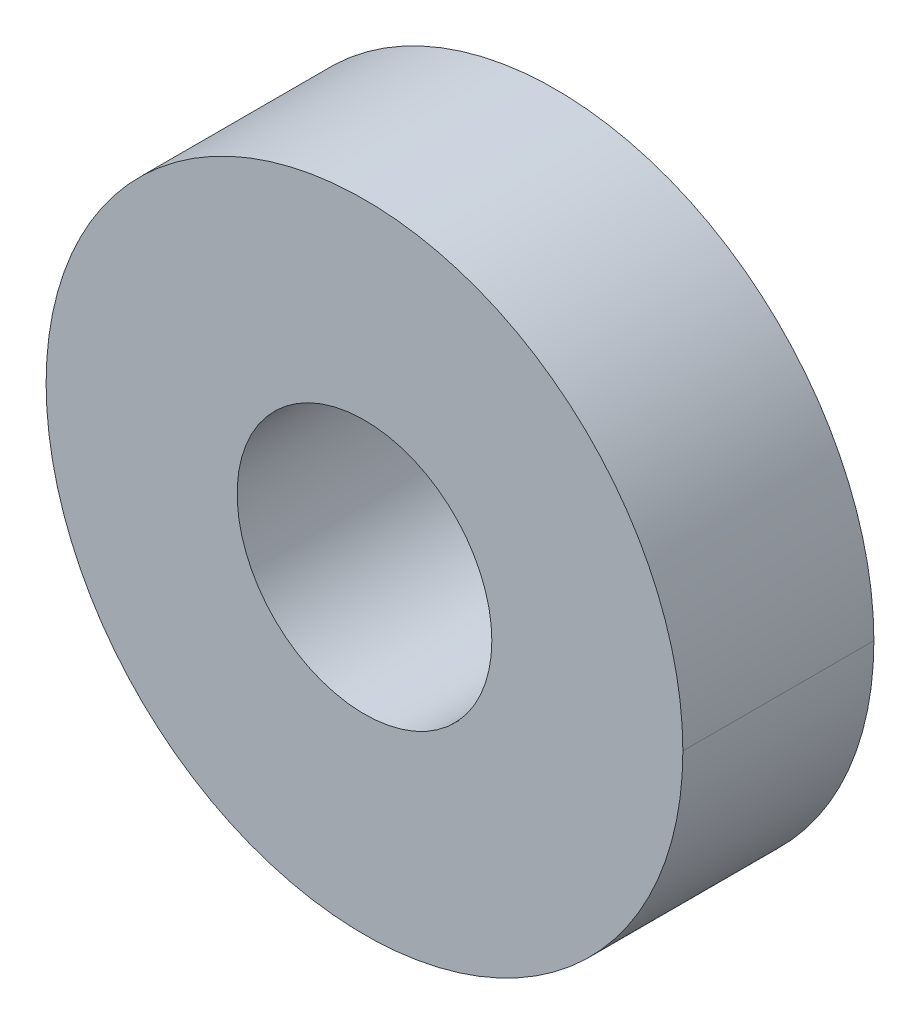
ISO-10303-21;
HEADER;
FILE_DESCRIPTION(('STEP AP214'),'2;1');
FILE_NAME('part.step','',(''),(''),'','','');
FILE_SCHEMA(('AUTOMOTIVE_DESIGN { 1 0 10303 214 1 1 1 1 }'));
ENDSEC;
DATA;
#1=APPLICATION_CONTEXT('core data for automotive mechanical design processes');
#2=APPLICATION_PROTOCOL_DEFINITION('international standard','automotive_design',2000,#1);
#3=PRODUCT_CONTEXT('',#1,'mechanical');
#4=PRODUCT('Part','Part','',(#3));
#5=PRODUCT_RELATED_PRODUCT_CATEGORY('part','',(#4));
#6=PRODUCT_DEFINITION_FORMATION('','',#4);
#7=PRODUCT_DEFINITION_CONTEXT('part definition',#1,'design');
#8=PRODUCT_DEFINITION('design','',#6,#7);
#9=PRODUCT_DEFINITION_SHAPE('','',#8);
#10=(LENGTH_UNIT() NAMED_UNIT(*) SI_UNIT(.MILLI.,.METRE.));
#11=(NAMED_UNIT(*) PLANE_ANGLE_UNIT() SI_UNIT($,.RADIAN.));
#12=(NAMED_UNIT(*) SI_UNIT($,.STERADIAN.) SOLID_ANGLE_UNIT());
#13=UNCERTAINTY_MEASURE_WITH_UNIT(LENGTH_MEASURE(1.E-05),#10,'distance_accuracy_value','');
#14=(GEOMETRIC_REPRESENTATION_CONTEXT(3) GLOBAL_UNCERTAINTY_ASSIGNED_CONTEXT((#13)) GLOBAL_UNIT_ASSIGNED_CONTEXT((#10,
#11,#12)) REPRESENTATION_CONTEXT('',''));
#15=CARTESIAN_POINT('',(0.,0.,0.));
#16=DIRECTION('',(0.,0.,1.));
#17=DIRECTION('',(1.,0.,0.));
#18=AXIS2_PLACEMENT_3D('',#15,#16,#17);
#19=CARTESIAN_POINT('',(8.93120842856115,26.4578481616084,0.));
#20=DIRECTION('',(0.,0.,1.));
#21=DIRECTION('',(1.,0.,0.));
#22=AXIS2_PLACEMENT_3D('',#19,#20,#21);
#23=PLANE('',#22);
#24=CARTESIAN_POINT('',(8.93120842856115,26.4578481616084,0.));
#25=DIRECTION('',(0.,0.,1.));
#26=DIRECTION('',(1.,0.,0.));
#27=AXIS2_PLACEMENT_3D('',#24,#25,#26);
#28=CIRCLE('',#27,2.);
#29=CARTESIAN_POINT('',(10.9312084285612,26.4578481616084,0.));
#30=VERTEX_POINT('',#29);
#31=EDGE_CURVE('E60',#30,#30,#28,.T.);
#32=ORIENTED_EDGE('',*,*,#31,.T.);
#33=EDGE_LOOP('',(#32));
#34=FACE_BOUND('',#33,.T.);
#35=CARTESIAN_POINT('',(8.93120842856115,26.4578481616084,0.));
#36=DIRECTION('',(0.,0.,-1.));
#37=DIRECTION('',(-1.,0.,0.));
#38=AXIS2_PLACEMENT_3D('',#35,#36,#37);
#39=CIRCLE('',#38,5.);
#40=CARTESIAN_POINT('',(13.9312084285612,26.4578481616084,0.));
#41=VERTEX_POINT('',#40);
#42=CARTESIAN_POINT('',(3.93120842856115,26.4578481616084,0.));
#43=VERTEX_POINT('',#42);
#44=EDGE_CURVE('E61',#41,#43,#39,.F.);
#45=ORIENTED_EDGE('',*,*,#44,.F.);
#46=CARTESIAN_POINT('',(8.93120842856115,26.4578481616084,0.));
#47=DIRECTION('',(0.,0.,-1.));
#48=DIRECTION('',(-1.,0.,0.));
#49=AXIS2_PLACEMENT_3D('',#46,#47,#48);
#50=CIRCLE('',#49,5.);
#51=EDGE_CURVE('E33',#43,#41,#50,.F.);
#52=ORIENTED_EDGE('',*,*,#51,.F.);
#53=EDGE_LOOP('',(#45,#52));
#54=FACE_BOUND('',#53,.T.);
#55=ADVANCED_FACE('F30',(#34,#54),#23,.F.);
#56=CARTESIAN_POINT('',(8.93120842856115,26.4578481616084,3.));
#57=DIRECTION('',(0.,0.,-1.));
#58=DIRECTION('',(-1.,0.,0.));
#59=AXIS2_PLACEMENT_3D('',#56,#57,#58);
#60=CYLINDRICAL_SURFACE('',#59,5.);
#61=DIRECTION('',(0.,0.,-1.));
#62=VECTOR('',#61,1.);
#63=CARTESIAN_POINT('',(3.93120842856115,26.4578481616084,3.));
#64=LINE('',#63,#62);
#65=CARTESIAN_POINT('',(3.93120842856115,26.4578481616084,3.));
#66=VERTEX_POINT('',#65);
#67=EDGE_CURVE('E58',#43,#66,#64,.F.);
#68=ORIENTED_EDGE('',*,*,#67,.F.);
#69=ORIENTED_EDGE('',*,*,#51,.T.);
#70=DIRECTION('',(0.,0.,-1.));
#71=VECTOR('',#70,1.);
#72=CARTESIAN_POINT('',(13.9312084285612,26.4578481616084,3.));
#73=LINE('',#72,#71);
#74=CARTESIAN_POINT('',(13.9312084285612,26.4578481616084,3.));
#75=VERTEX_POINT('',#74);
#76=EDGE_CURVE('E48',#75,#41,#73,.T.);
#77=ORIENTED_EDGE('',*,*,#76,.F.);
#78=CARTESIAN_POINT('',(8.93120842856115,26.4578481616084,3.));
#79=DIRECTION('',(0.,0.,-1.));
#80=DIRECTION('',(-1.,0.,0.));
#81=AXIS2_PLACEMENT_3D('',#78,#79,#80);
#82=CIRCLE('',#81,5.);
#83=EDGE_CURVE('E39',#66,#75,#82,.F.);
#84=ORIENTED_EDGE('',*,*,#83,.F.);
#85=EDGE_LOOP('',(#68,#69,#77,#84));
#86=FACE_BOUND('',#85,.T.);
#87=ADVANCED_FACE('F56',(#86),#60,.T.);
#88=CARTESIAN_POINT('',(8.93120842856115,26.4578481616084,3.));
#89=DIRECTION('',(0.,0.,-1.));
#90=DIRECTION('',(-1.,0.,0.));
#91=AXIS2_PLACEMENT_3D('',#88,#89,#90);
#92=CYLINDRICAL_SURFACE('',#91,5.);
#93=ORIENTED_EDGE('',*,*,#44,.T.);
#94=ORIENTED_EDGE('',*,*,#67,.T.);
#95=CARTESIAN_POINT('',(8.93120842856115,26.4578481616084,3.));
#96=DIRECTION('',(0.,0.,-1.));
#97=DIRECTION('',(-1.,0.,0.));
#98=AXIS2_PLACEMENT_3D('',#95,#96,#97);
#99=CIRCLE('',#98,5.);
#100=EDGE_CURVE('E11',#75,#66,#99,.F.);
#101=ORIENTED_EDGE('',*,*,#100,.F.);
#102=ORIENTED_EDGE('',*,*,#76,.T.);
#103=EDGE_LOOP('',(#93,#94,#101,#102));
#104=FACE_BOUND('',#103,.T.);
#105=ADVANCED_FACE('F63',(#104),#92,.T.);
#106=CARTESIAN_POINT('',(8.93120842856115,26.4578481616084,3.));
#107=DIRECTION('',(0.,0.,1.));
#108=DIRECTION('',(1.,0.,0.));
#109=AXIS2_PLACEMENT_3D('',#106,#107,#108);
#110=PLANE('',#109);
#111=CARTESIAN_POINT('',(8.93120842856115,26.4578481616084,3.));
#112=DIRECTION('',(0.,0.,1.));
#113=DIRECTION('',(1.,0.,0.));
#114=AXIS2_PLACEMENT_3D('',#111,#112,#113);
#115=CIRCLE('',#114,2.);
#116=CARTESIAN_POINT('',(10.9312084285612,26.4578481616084,3.));
#117=VERTEX_POINT('',#116);
#118=EDGE_CURVE('E92',#117,#117,#115,.T.);
#119=ORIENTED_EDGE('',*,*,#118,.F.);
#120=EDGE_LOOP('',(#119));
#121=FACE_BOUND('',#120,.T.);
#122=ORIENTED_EDGE('',*,*,#83,.T.);
#123=ORIENTED_EDGE('',*,*,#100,.T.);
#124=EDGE_LOOP('',(#122,#123));
#125=FACE_BOUND('',#124,.T.);
#126=ADVANCED_FACE('F70',(#121,#125),#110,.T.);
#127=CARTESIAN_POINT('',(8.93120842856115,26.4578481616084,0.));
#128=DIRECTION('',(0.,0.,1.));
#129=DIRECTION('',(1.,0.,0.));
#130=AXIS2_PLACEMENT_3D('',#127,#128,#129);
#131=CYLINDRICAL_SURFACE('',#130,2.);
#132=ORIENTED_EDGE('',*,*,#31,.F.);
#133=EDGE_LOOP('',(#132));
#134=FACE_BOUND('',#133,.T.);
#135=ORIENTED_EDGE('',*,*,#118,.T.);
#136=EDGE_LOOP('',(#135));
#137=FACE_BOUND('',#136,.T.);
#138=ADVANCED_FACE('F72',(#134,#137),#131,.F.);
#139=CLOSED_SHELL('',(#55,#87,#105,#126,#138));
#140=MANIFOLD_SOLID_BREP('B2',#139);
#141=ADVANCED_BREP_SHAPE_REPRESENTATION('',(#18,#140),#14);
#142=SHAPE_DEFINITION_REPRESENTATION(#9,#141);
ENDSEC;
END-ISO-10303-21;
